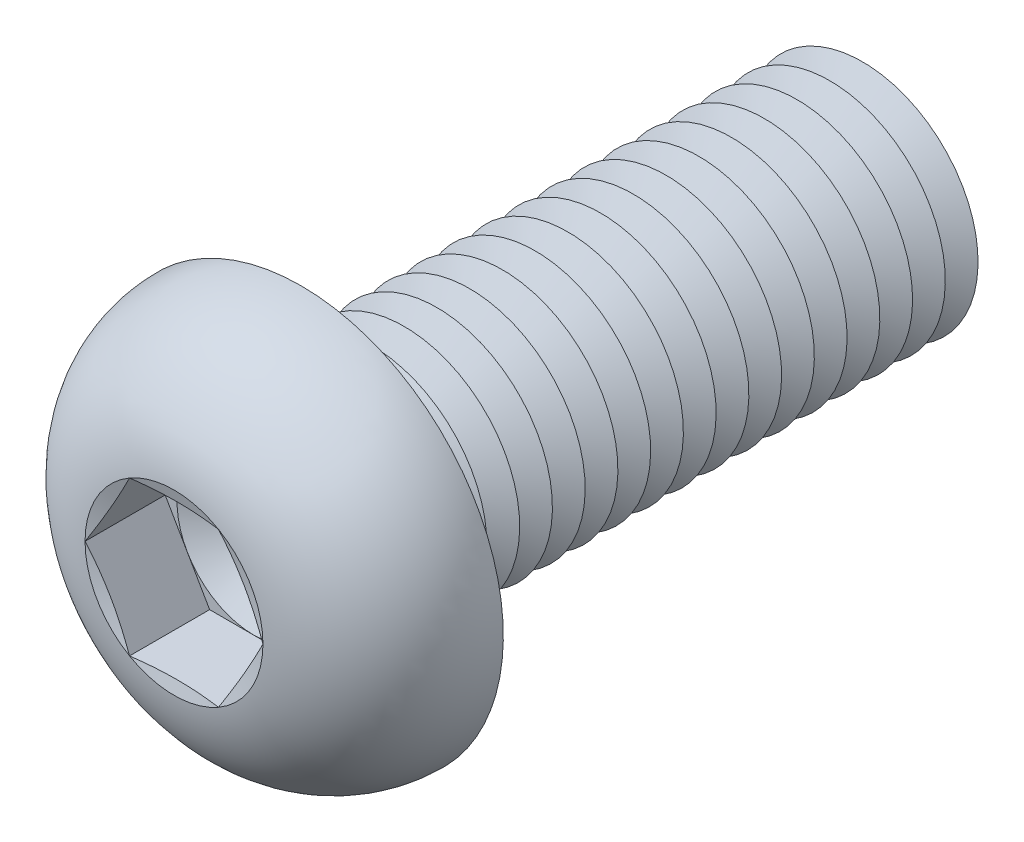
ISO-10303-21;
HEADER;
FILE_DESCRIPTION(('STEP AP214'),'2;1');
FILE_NAME('part.step','',(''),(''),'','','');
FILE_SCHEMA(('AUTOMOTIVE_DESIGN { 1 0 10303 214 1 1 1 1 }'));
ENDSEC;
DATA;
#1=APPLICATION_CONTEXT('core data for automotive mechanical design processes');
#2=APPLICATION_PROTOCOL_DEFINITION('international standard','automotive_design',2000,#1);
#3=PRODUCT_CONTEXT('',#1,'mechanical');
#4=PRODUCT('Part','Part','',(#3));
#5=PRODUCT_RELATED_PRODUCT_CATEGORY('part','',(#4));
#6=PRODUCT_DEFINITION_FORMATION('','',#4);
#7=PRODUCT_DEFINITION_CONTEXT('part definition',#1,'design');
#8=PRODUCT_DEFINITION('design','',#6,#7);
#9=PRODUCT_DEFINITION_SHAPE('','',#8);
#10=(LENGTH_UNIT() NAMED_UNIT(*) SI_UNIT(.MILLI.,.METRE.));
#11=(NAMED_UNIT(*) PLANE_ANGLE_UNIT() SI_UNIT($,.RADIAN.));
#12=(NAMED_UNIT(*) SI_UNIT($,.STERADIAN.) SOLID_ANGLE_UNIT());
#13=UNCERTAINTY_MEASURE_WITH_UNIT(LENGTH_MEASURE(1.E-05),#10,'distance_accuracy_value','');
#14=(GEOMETRIC_REPRESENTATION_CONTEXT(3) GLOBAL_UNCERTAINTY_ASSIGNED_CONTEXT((#13)) GLOBAL_UNIT_ASSIGNED_CONTEXT((#10,
#11,#12)) REPRESENTATION_CONTEXT('',''));
#15=CARTESIAN_POINT('',(0.,0.,0.));
#16=DIRECTION('',(0.,0.,1.));
#17=DIRECTION('',(1.,0.,0.));
#18=AXIS2_PLACEMENT_3D('',#15,#16,#17);
#19=CARTESIAN_POINT('',(0.,0.,2.43999999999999));
#20=DIRECTION('',(0.,0.,1.));
#21=DIRECTION('',(1.,0.,0.));
#22=AXIS2_PLACEMENT_3D('',#19,#20,#21);
#23=PLANE('',#22);
#24=CARTESIAN_POINT('',(0.,0.,2.43999999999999));
#25=DIRECTION('',(0.,0.,1.));
#26=DIRECTION('',(1.,0.,0.));
#27=AXIS2_PLACEMENT_3D('',#24,#25,#26);
#28=CIRCLE('',#27,3.99999813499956);
#29=CARTESIAN_POINT('',(3.4641,1.99999906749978,2.43999999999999));
#30=VERTEX_POINT('',#29);
#31=CARTESIAN_POINT('',(0.,3.99999813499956,2.43999999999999));
#32=VERTEX_POINT('',#31);
#33=EDGE_CURVE('E118',#30,#32,#28,.T.);
#34=ORIENTED_EDGE('',*,*,#33,.F.);
#35=DIRECTION('',(-0.5,0.866025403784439,0.));
#36=VECTOR('',#35,1.);
#37=CARTESIAN_POINT('',(4.6188,0.,2.43999999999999));
#38=LINE('',#37,#36);
#39=CARTESIAN_POINT('',(2.3094,3.99999813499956,2.43999999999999));
#40=VERTEX_POINT('',#39);
#41=EDGE_CURVE('E125',#30,#40,#38,.T.);
#42=ORIENTED_EDGE('',*,*,#41,.T.);
#43=DIRECTION('',(-1.,0.,0.));
#44=VECTOR('',#43,1.);
#45=CARTESIAN_POINT('',(2.3094,3.99999813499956,2.43999999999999));
#46=LINE('',#45,#44);
#47=EDGE_CURVE('E136',#40,#32,#46,.T.);
#48=ORIENTED_EDGE('',*,*,#47,.T.);
#49=EDGE_LOOP('',(#34,#42,#48));
#50=FACE_BOUND('',#49,.T.);
#51=ADVANCED_FACE('F39',(#50),#23,.T.);
#52=CARTESIAN_POINT('',(0.,0.,2.43999999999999));
#53=DIRECTION('',(0.,0.,1.));
#54=DIRECTION('',(1.,0.,0.));
#55=AXIS2_PLACEMENT_3D('',#52,#53,#54);
#56=CIRCLE('',#55,3.99999813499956);
#57=CARTESIAN_POINT('',(-3.4641,1.99999906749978,2.43999999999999));
#58=VERTEX_POINT('',#57);
#59=EDGE_CURVE('E11',#32,#58,#56,.T.);
#60=ORIENTED_EDGE('',*,*,#59,.F.);
#61=CARTESIAN_POINT('',(-2.3094,3.99999813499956,2.43999999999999));
#62=VERTEX_POINT('',#61);
#63=EDGE_CURVE('E131',#32,#62,#46,.T.);
#64=ORIENTED_EDGE('',*,*,#63,.T.);
#65=DIRECTION('',(-0.5,-0.866025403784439,0.));
#66=VECTOR('',#65,1.);
#67=CARTESIAN_POINT('',(-2.3094,3.99999813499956,2.43999999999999));
#68=LINE('',#67,#66);
#69=EDGE_CURVE('E134',#62,#58,#68,.T.);
#70=ORIENTED_EDGE('',*,*,#69,.T.);
#71=EDGE_LOOP('',(#60,#64,#70));
#72=FACE_BOUND('',#71,.T.);
#73=ADVANCED_FACE('F130',(#72),#23,.T.);
#74=CARTESIAN_POINT('',(-3.4641,-1.99999906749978,2.43999999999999));
#75=VERTEX_POINT('',#74);
#76=EDGE_CURVE('E49',#58,#75,#56,.T.);
#77=ORIENTED_EDGE('',*,*,#76,.F.);
#78=CARTESIAN_POINT('',(-4.6188,0.,2.43999999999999));
#79=VERTEX_POINT('',#78);
#80=EDGE_CURVE('E143',#58,#79,#68,.T.);
#81=ORIENTED_EDGE('',*,*,#80,.T.);
#82=DIRECTION('',(0.5,-0.866025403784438,0.));
#83=VECTOR('',#82,1.);
#84=CARTESIAN_POINT('',(-4.6188,0.,2.43999999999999));
#85=LINE('',#84,#83);
#86=EDGE_CURVE('E152',#79,#75,#85,.T.);
#87=ORIENTED_EDGE('',*,*,#86,.T.);
#88=EDGE_LOOP('',(#77,#81,#87));
#89=FACE_BOUND('',#88,.T.);
#90=ADVANCED_FACE('F409',(#89),#23,.T.);
#91=CARTESIAN_POINT('',(0.,-3.99999813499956,2.43999999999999));
#92=VERTEX_POINT('',#91);
#93=EDGE_CURVE('E393',#75,#92,#56,.T.);
#94=ORIENTED_EDGE('',*,*,#93,.F.);
#95=CARTESIAN_POINT('',(-2.3094,-3.99999813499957,2.43999999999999));
#96=VERTEX_POINT('',#95);
#97=EDGE_CURVE('E151',#75,#96,#85,.T.);
#98=ORIENTED_EDGE('',*,*,#97,.T.);
#99=DIRECTION('',(1.,0.,0.));
#100=VECTOR('',#99,1.);
#101=CARTESIAN_POINT('',(-2.3094,-3.99999813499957,2.43999999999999));
#102=LINE('',#101,#100);
#103=EDGE_CURVE('E157',#96,#92,#102,.T.);
#104=ORIENTED_EDGE('',*,*,#103,.T.);
#105=EDGE_LOOP('',(#94,#98,#104));
#106=FACE_BOUND('',#105,.T.);
#107=ADVANCED_FACE('F403',(#106),#23,.T.);
#108=CARTESIAN_POINT('',(3.4641,-1.99999906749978,2.43999999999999));
#109=VERTEX_POINT('',#108);
#110=EDGE_CURVE('E56',#92,#109,#56,.T.);
#111=ORIENTED_EDGE('',*,*,#110,.F.);
#112=CARTESIAN_POINT('',(2.3094,-3.99999813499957,2.43999999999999));
#113=VERTEX_POINT('',#112);
#114=EDGE_CURVE('E156',#92,#113,#102,.T.);
#115=ORIENTED_EDGE('',*,*,#114,.T.);
#116=DIRECTION('',(0.5,0.866025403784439,0.));
#117=VECTOR('',#116,1.);
#118=CARTESIAN_POINT('',(2.3094,-3.99999813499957,2.43999999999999));
#119=LINE('',#118,#117);
#120=EDGE_CURVE('E162',#113,#109,#119,.T.);
#121=ORIENTED_EDGE('',*,*,#120,.T.);
#122=EDGE_LOOP('',(#111,#115,#121));
#123=FACE_BOUND('',#122,.T.);
#124=ADVANCED_FACE('F478',(#123),#23,.T.);
#125=CARTESIAN_POINT('',(0.,0.,6.59999999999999));
#126=DIRECTION('',(0.,0.,1.));
#127=DIRECTION('',(0.,-1.,0.));
#128=AXIS2_PLACEMENT_3D('',#125,#126,#127);
#129=CONICAL_SURFACE('',#128,4.6188,1.30899693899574);
#130=CARTESIAN_POINT('',(4.61891547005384,-0.000200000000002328,6.6000309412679));
#131=CARTESIAN_POINT('',(4.52300232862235,0.165926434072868,6.57431944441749));
#132=CARTESIAN_POINT('',(4.42691527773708,0.332354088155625,6.55097758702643));
#133=CARTESIAN_POINT('',(4.23440181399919,0.665797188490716,6.50996805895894));
#134=CARTESIAN_POINT('',(4.13797527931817,0.83281284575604,6.49230269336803));
#135=CARTESIAN_POINT('',(3.94536752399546,1.16641926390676,6.46367750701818));
#136=CARTESIAN_POINT('',(3.84918760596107,1.33300776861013,6.45268354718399));
#137=CARTESIAN_POINT('',(3.6567051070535,1.66639723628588,6.4379417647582));
#138=CARTESIAN_POINT('',(3.56040255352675,1.83319815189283,6.43419253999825));
#139=CARTESIAN_POINT('',(3.36779744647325,2.16679998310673,6.43419253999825));
#140=CARTESIAN_POINT('',(3.2714948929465,2.33360089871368,6.4379417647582));
#141=CARTESIAN_POINT('',(3.07901239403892,2.66699036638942,6.45268354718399));
#142=CARTESIAN_POINT('',(2.98283247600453,2.8335788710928,6.46367750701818));
#143=CARTESIAN_POINT('',(2.79022472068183,3.16718528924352,6.49230269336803));
#144=CARTESIAN_POINT('',(2.69379818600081,3.33420094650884,6.50996805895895));
#145=CARTESIAN_POINT('',(2.50128472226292,3.66764404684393,6.55097758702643));
#146=CARTESIAN_POINT('',(2.40519767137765,3.83407170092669,6.57431944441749));
#147=CARTESIAN_POINT('',(2.30928452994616,4.00019813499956,6.6000309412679));
#148=B_SPLINE_CURVE_WITH_KNOTS('',3,(#130,#131,#132,#133,#134,#135,#136,#137,#138,#139,#140,
#141,#142,#143,#144,#145,#146,#147),.UNSPECIFIED.,.F.,.F.,(4,2,2,2,2,2,2,2,4),(0.,
0.580655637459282,1.16154676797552,1.73943971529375,2.31722080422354,2.89500189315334,
3.47289484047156,4.05378597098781,4.63444160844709),.UNSPECIFIED.);
#149=CARTESIAN_POINT('',(4.6188,0.,6.59999999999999));
#150=VERTEX_POINT('',#149);
#151=CARTESIAN_POINT('',(2.30939999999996,3.99999813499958,6.6));
#152=VERTEX_POINT('',#151);
#153=EDGE_CURVE('E222',#150,#152,#148,.T.);
#154=ORIENTED_EDGE('',*,*,#153,.F.);
#155=CARTESIAN_POINT('',(0.,0.,6.59999999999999));
#156=DIRECTION('',(0.,0.,-1.));
#157=DIRECTION('',(0.,1.,0.));
#158=AXIS2_PLACEMENT_3D('',#155,#156,#157);
#159=CIRCLE('',#158,4.6188);
#160=EDGE_CURVE('E374',#152,#150,#159,.T.);
#161=ORIENTED_EDGE('',*,*,#160,.F.);
#162=EDGE_LOOP('',(#154,#161));
#163=FACE_BOUND('',#162,.T.);
#164=ADVANCED_FACE('F482',(#163),#129,.F.);
#165=CARTESIAN_POINT('',(2.30928452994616,-4.00019813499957,6.60003094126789));
#166=CARTESIAN_POINT('',(2.40519767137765,-3.8340717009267,6.57431944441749));
#167=CARTESIAN_POINT('',(2.50128472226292,-3.66764404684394,6.55097758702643));
#168=CARTESIAN_POINT('',(2.69379818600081,-3.33420094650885,6.50996805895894));
#169=CARTESIAN_POINT('',(2.79022472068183,-3.16718528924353,6.49230269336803));
#170=CARTESIAN_POINT('',(2.98283247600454,-2.8335788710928,6.46367750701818));
#171=CARTESIAN_POINT('',(3.07901239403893,-2.66699036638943,6.45268354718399));
#172=CARTESIAN_POINT('',(3.2714948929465,-2.33360089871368,6.4379417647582));
#173=CARTESIAN_POINT('',(3.36779744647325,-2.16679998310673,6.43419253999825));
#174=CARTESIAN_POINT('',(3.56040255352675,-1.83319815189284,6.43419253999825));
#175=CARTESIAN_POINT('',(3.6567051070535,-1.66639723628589,6.4379417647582));
#176=CARTESIAN_POINT('',(3.84918760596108,-1.33300776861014,6.45268354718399));
#177=CARTESIAN_POINT('',(3.94536752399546,-1.16641926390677,6.46367750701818));
#178=CARTESIAN_POINT('',(4.13797527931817,-0.832812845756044,6.49230269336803));
#179=CARTESIAN_POINT('',(4.23440181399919,-0.66579718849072,6.50996805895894));
#180=CARTESIAN_POINT('',(4.42691527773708,-0.332354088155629,6.55097758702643));
#181=CARTESIAN_POINT('',(4.52300232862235,-0.165926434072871,6.57431944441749));
#182=CARTESIAN_POINT('',(4.61891547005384,0.000199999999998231,6.6000309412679));
#183=B_SPLINE_CURVE_WITH_KNOTS('',3,(#165,#166,#167,#168,#169,#170,#171,#172,#173,#174,#175,
#176,#177,#178,#179,#180,#181,#182),.UNSPECIFIED.,.F.,.F.,(4,2,2,2,2,2,2,2,4),(0.,
0.580655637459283,1.16154676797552,1.73943971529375,2.31722080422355,2.89500189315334,
3.47289484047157,4.05378597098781,4.63444160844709),.UNSPECIFIED.);
#184=CARTESIAN_POINT('',(2.3094,-3.99999813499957,6.59999999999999));
#185=VERTEX_POINT('',#184);
#186=EDGE_CURVE('E231',#185,#150,#183,.T.);
#187=ORIENTED_EDGE('',*,*,#186,.F.);
#188=EDGE_CURVE('E379',#150,#185,#159,.T.);
#189=ORIENTED_EDGE('',*,*,#188,.F.);
#190=EDGE_LOOP('',(#187,#189));
#191=FACE_BOUND('',#190,.T.);
#192=ADVANCED_FACE('F443',(#191),#129,.F.);
#193=CARTESIAN_POINT('',(-6.96966750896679,-3.99999813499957,7.51561854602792));
#194=CARTESIAN_POINT('',(-6.80094634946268,-3.99999813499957,7.47641178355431));
#195=CARTESIAN_POINT('',(-6.63214895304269,-3.99999813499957,7.43753277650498));
#196=CARTESIAN_POINT('',(-6.29436999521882,-3.99999813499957,7.36057075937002));
#197=CARTESIAN_POINT('',(-6.12538843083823,-3.99999813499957,7.3224877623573));
#198=CARTESIAN_POINT('',(-5.61806276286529,-3.99999813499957,7.20963087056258));
#199=CARTESIAN_POINT('',(-5.27940301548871,-3.99999813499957,7.13626437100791));
#200=CARTESIAN_POINT('',(-4.59775760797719,-3.99999813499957,6.99431141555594));
#201=CARTESIAN_POINT('',(-4.25476115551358,-3.99999813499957,6.92577621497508));
#202=CARTESIAN_POINT('',(-3.56716783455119,-3.99999813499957,6.79696563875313));
#203=CARTESIAN_POINT('',(-3.22257082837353,-3.99999813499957,6.73669098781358));
#204=CARTESIAN_POINT('',(-2.54069952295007,-3.99999813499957,6.63002020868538));
#205=CARTESIAN_POINT('',(-2.20347918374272,-3.99999813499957,6.58329286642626));
#206=CARTESIAN_POINT('',(-1.6962445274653,-3.99999813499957,6.52585827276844));
#207=CARTESIAN_POINT('',(-1.52694760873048,-3.99999813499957,6.50882377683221));
#208=CARTESIAN_POINT('',(-1.187938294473,-3.99999813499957,6.47963274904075));
#209=CARTESIAN_POINT('',(-1.01822592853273,-3.99999813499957,6.4674758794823));
#210=CARTESIAN_POINT('',(-0.679233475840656,-3.99999813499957,6.44863176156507));
#211=CARTESIAN_POINT('',(-0.509954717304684,-3.99999813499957,6.44192096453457));
#212=CARTESIAN_POINT('',(-0.171265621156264,-3.99999813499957,6.43422163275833));
#213=CARTESIAN_POINT('',(-0.00185528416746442,-3.99999813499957,6.43323307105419));
#214=CARTESIAN_POINT('',(0.336912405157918,-3.99999813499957,6.43703123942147));
#215=CARTESIAN_POINT('',(0.506269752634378,-3.99999813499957,6.44181839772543));
#216=CARTESIAN_POINT('',(0.844732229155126,-3.99999813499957,6.45691823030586));
#217=CARTESIAN_POINT('',(1.01383735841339,-3.99999813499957,6.46723089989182));
#218=CARTESIAN_POINT('',(1.42449950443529,-3.99999813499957,6.49843349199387));
#219=CARTESIAN_POINT('',(1.66585565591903,-3.99999813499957,6.52196685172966));
#220=CARTESIAN_POINT('',(2.14755410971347,-3.99999813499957,6.57749710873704));
#221=CARTESIAN_POINT('',(2.3878964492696,-3.99999813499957,6.60949369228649));
#222=CARTESIAN_POINT('',(2.86835569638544,-3.99999813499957,6.68017769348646));
#223=CARTESIAN_POINT('',(3.10846949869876,-3.99999813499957,6.71888590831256));
#224=CARTESIAN_POINT('',(3.5878341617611,-3.99999813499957,6.80132981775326));
#225=CARTESIAN_POINT('',(3.82708497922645,-3.99999813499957,6.84506576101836));
#226=CARTESIAN_POINT('',(4.30977392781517,-3.99999813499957,6.93726543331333));
#227=CARTESIAN_POINT('',(4.55319689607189,-3.99999813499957,6.98580793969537));
#228=CARTESIAN_POINT('',(5.03943022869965,-3.99999813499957,7.08586668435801));
#229=CARTESIAN_POINT('',(5.28224058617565,-3.99999813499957,7.13738295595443));
#230=CARTESIAN_POINT('',(5.76604885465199,-3.99999813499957,7.24238429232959));
#231=CARTESIAN_POINT('',(6.00704943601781,-3.99999813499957,7.29585711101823));
#232=CARTESIAN_POINT('',(6.48863948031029,-3.99999813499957,7.4045482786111));
#233=CARTESIAN_POINT('',(6.72922897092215,-3.99999813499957,7.45976650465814));
#234=CARTESIAN_POINT('',(6.9696675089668,-3.99999813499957,7.51561854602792));
#235=B_SPLINE_CURVE_WITH_KNOTS('',3,(#193,#194,#195,#196,#197,#198,#199,#200,#201,#202,#203,
#204,#205,#206,#207,#208,#209,#210,#211,#212,#213,#214,#215,#216,#217,#218,#219,#220,#221,#222,
#223,#224,#225,#226,#227,#228,#229,#230,#231,#232,#233,#234),.UNSPECIFIED.,.F.,.F.,(4,2,2,2,2,2,
2,2,2,2,2,2,2,2,2,2,2,2,2,2,4),(0.,0.519649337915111,1.03930720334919,2.07882421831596,
3.12808572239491,4.17743921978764,5.19841727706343,5.7088142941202,6.21917596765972,
6.7273189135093,7.23545946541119,7.74363769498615,8.25181549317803,8.9791183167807,
9.70639418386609,10.4359652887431,11.1655724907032,11.910195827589,12.6548275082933,
13.395405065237,14.1359306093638),.UNSPECIFIED.);
#236=CARTESIAN_POINT('',(-2.3094,-3.99999813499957,6.59999999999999));
#237=VERTEX_POINT('',#236);
#238=EDGE_CURVE('E423',#237,#185,#235,.T.);
#239=ORIENTED_EDGE('',*,*,#238,.F.);
#240=EDGE_CURVE('E435',#185,#237,#159,.T.);
#241=ORIENTED_EDGE('',*,*,#240,.F.);
#242=EDGE_LOOP('',(#239,#241));
#243=FACE_BOUND('',#242,.T.);
#244=ADVANCED_FACE('F449',(#243),#129,.F.);
#245=CARTESIAN_POINT('',(-4.61891547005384,0.000199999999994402,6.6000309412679));
#246=CARTESIAN_POINT('',(-4.52300232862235,-0.165926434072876,6.57431944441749));
#247=CARTESIAN_POINT('',(-4.42691527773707,-0.332354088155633,6.55097758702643));
#248=CARTESIAN_POINT('',(-4.23440181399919,-0.665797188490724,6.50996805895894));
#249=CARTESIAN_POINT('',(-4.13797527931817,-0.832812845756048,6.49230269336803));
#250=CARTESIAN_POINT('',(-3.94536752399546,-1.16641926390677,6.46367750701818));
#251=CARTESIAN_POINT('',(-3.84918760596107,-1.33300776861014,6.45268354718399));
#252=CARTESIAN_POINT('',(-3.6567051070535,-1.66639723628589,6.4379417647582));
#253=CARTESIAN_POINT('',(-3.56040255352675,-1.83319815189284,6.43419253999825));
#254=CARTESIAN_POINT('',(-3.36779744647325,-2.16679998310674,6.43419253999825));
#255=CARTESIAN_POINT('',(-3.2714948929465,-2.33360089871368,6.4379417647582));
#256=CARTESIAN_POINT('',(-3.07901239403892,-2.66699036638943,6.45268354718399));
#257=CARTESIAN_POINT('',(-2.98283247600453,-2.83357887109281,6.46367750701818));
#258=CARTESIAN_POINT('',(-2.79022472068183,-3.16718528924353,6.49230269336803));
#259=CARTESIAN_POINT('',(-2.69379818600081,-3.33420094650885,6.50996805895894));
#260=CARTESIAN_POINT('',(-2.50128472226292,-3.66764404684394,6.55097758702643));
#261=CARTESIAN_POINT('',(-2.40519767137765,-3.8340717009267,6.57431944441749));
#262=CARTESIAN_POINT('',(-2.30928452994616,-4.00019813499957,6.60003094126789));
#263=B_SPLINE_CURVE_WITH_KNOTS('',3,(#245,#246,#247,#248,#249,#250,#251,#252,#253,#254,#255,
#256,#257,#258,#259,#260,#261,#262),.UNSPECIFIED.,.F.,.F.,(4,2,2,2,2,2,2,2,4),(0.,
0.580655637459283,1.16154676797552,1.73943971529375,2.31722080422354,2.89500189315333,
3.47289484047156,4.05378597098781,4.63444160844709),.UNSPECIFIED.);
#264=CARTESIAN_POINT('',(-4.6188,0.,6.59999999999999));
#265=VERTEX_POINT('',#264);
#266=EDGE_CURVE('E414',#265,#237,#263,.T.);
#267=ORIENTED_EDGE('',*,*,#266,.F.);
#268=EDGE_CURVE('E420',#237,#265,#159,.T.);
#269=ORIENTED_EDGE('',*,*,#268,.F.);
#270=EDGE_LOOP('',(#267,#269));
#271=FACE_BOUND('',#270,.T.);
#272=ADVANCED_FACE('F418',(#271),#129,.F.);
#273=CARTESIAN_POINT('',(-2.30928452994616,4.00019813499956,6.6000309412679));
#274=CARTESIAN_POINT('',(-2.40519767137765,3.83407170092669,6.57431944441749));
#275=CARTESIAN_POINT('',(-2.50128472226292,3.66764404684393,6.55097758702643));
#276=CARTESIAN_POINT('',(-2.69379818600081,3.33420094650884,6.50996805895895));
#277=CARTESIAN_POINT('',(-2.79022472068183,3.16718528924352,6.49230269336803));
#278=CARTESIAN_POINT('',(-2.98283247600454,2.8335788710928,6.46367750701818));
#279=CARTESIAN_POINT('',(-3.07901239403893,2.66699036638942,6.45268354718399));
#280=CARTESIAN_POINT('',(-3.2714948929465,2.33360089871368,6.4379417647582));
#281=CARTESIAN_POINT('',(-3.36779744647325,2.16679998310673,6.43419253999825));
#282=CARTESIAN_POINT('',(-3.56040255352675,1.83319815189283,6.43419253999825));
#283=CARTESIAN_POINT('',(-3.6567051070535,1.66639723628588,6.4379417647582));
#284=CARTESIAN_POINT('',(-3.84918760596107,1.33300776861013,6.45268354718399));
#285=CARTESIAN_POINT('',(-3.94536752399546,1.16641926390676,6.46367750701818));
#286=CARTESIAN_POINT('',(-4.13797527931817,0.832812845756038,6.49230269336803));
#287=CARTESIAN_POINT('',(-4.23440181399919,0.665797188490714,6.50996805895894));
#288=CARTESIAN_POINT('',(-4.42691527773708,0.332354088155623,6.55097758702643));
#289=CARTESIAN_POINT('',(-4.52300232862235,0.165926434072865,6.57431944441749));
#290=CARTESIAN_POINT('',(-4.61891547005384,-0.000200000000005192,6.6000309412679));
#291=B_SPLINE_CURVE_WITH_KNOTS('',3,(#273,#274,#275,#276,#277,#278,#279,#280,#281,#282,#283,
#284,#285,#286,#287,#288,#289,#290),.UNSPECIFIED.,.F.,.F.,(4,2,2,2,2,2,2,2,4),(0.,
0.580655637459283,1.16154676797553,1.73943971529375,2.31722080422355,2.89500189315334,
3.47289484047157,4.05378597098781,4.63444160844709),.UNSPECIFIED.);
#292=CARTESIAN_POINT('',(-2.3094,3.99999813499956,6.59999999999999));
#293=VERTEX_POINT('',#292);
#294=EDGE_CURVE('E195',#293,#265,#291,.T.);
#295=ORIENTED_EDGE('',*,*,#294,.F.);
#296=EDGE_CURVE('E426',#265,#293,#159,.T.);
#297=ORIENTED_EDGE('',*,*,#296,.F.);
#298=EDGE_LOOP('',(#295,#297));
#299=FACE_BOUND('',#298,.T.);
#300=ADVANCED_FACE('F427',(#299),#129,.F.);
#301=CARTESIAN_POINT('',(0.,0.,-24.05));
#302=DIRECTION('',(0.,0.,1.));
#303=DIRECTION('',(0.,-1.,0.));
#304=AXIS2_PLACEMENT_3D('',#301,#302,#303);
#305=CONICAL_SURFACE('',#304,5.99999999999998,1.0471975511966);
#306=CARTESIAN_POINT('',(0.,0.,-24.9));
#307=DIRECTION('',(0.,0.,1.));
#308=DIRECTION('',(0.,-1.,0.));
#309=AXIS2_PLACEMENT_3D('',#306,#307,#308);
#310=CIRCLE('',#309,4.52775681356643);
#311=CARTESIAN_POINT('',(0.,-4.52775681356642,-24.9));
#312=VERTEX_POINT('',#311);
#313=EDGE_CURVE('E345',#312,#312,#310,.T.);
#314=ORIENTED_EDGE('',*,*,#313,.T.);
#315=EDGE_LOOP('',(#314));
#316=FACE_BOUND('',#315,.T.);
#317=CARTESIAN_POINT('',(0.,0.,-24.05));
#318=DIRECTION('',(0.,0.,1.));
#319=DIRECTION('',(0.,-1.,0.));
#320=AXIS2_PLACEMENT_3D('',#317,#318,#319);
#321=CIRCLE('',#320,5.99999999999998);
#322=CARTESIAN_POINT('',(0.,-5.99999999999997,-24.05));
#323=VERTEX_POINT('',#322);
#324=EDGE_CURVE('E341',#323,#323,#321,.T.);
#325=ORIENTED_EDGE('',*,*,#324,.F.);
#326=EDGE_LOOP('',(#325));
#327=FACE_BOUND('',#326,.T.);
#328=ADVANCED_FACE('F509',(#316,#327),#305,.T.);
#329=CARTESIAN_POINT('',(0.,0.,-24.9));
#330=DIRECTION('',(0.,0.,-1.));
#331=DIRECTION('',(0.,1.,0.));
#332=AXIS2_PLACEMENT_3D('',#329,#330,#331);
#333=CONICAL_SURFACE('',#332,4.52775681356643,1.0471975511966);
#334=CARTESIAN_POINT('',(0.,0.,-25.75));
#335=DIRECTION('',(0.,0.,1.));
#336=DIRECTION('',(0.,-1.,0.));
#337=AXIS2_PLACEMENT_3D('',#334,#335,#336);
#338=CIRCLE('',#337,5.99999999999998);
#339=CARTESIAN_POINT('',(0.,-5.99999999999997,-25.75));
#340=VERTEX_POINT('',#339);
#341=EDGE_CURVE('E349',#340,#340,#338,.T.);
#342=ORIENTED_EDGE('',*,*,#341,.T.);
#343=EDGE_LOOP('',(#342));
#344=FACE_BOUND('',#343,.T.);
#345=ORIENTED_EDGE('',*,*,#313,.F.);
#346=EDGE_LOOP('',(#345));
#347=FACE_BOUND('',#346,.T.);
#348=ADVANCED_FACE('F514',(#344,#347),#333,.T.);
#349=CARTESIAN_POINT('',(0.,6.,-30.));
#350=DIRECTION('',(0.,0.,-1.));
#351=DIRECTION('',(0.,1.,0.));
#352=AXIS2_PLACEMENT_3D('',#349,#350,#351);
#353=PLANE('',#352);
#354=CARTESIAN_POINT('',(0.,0.,-30.));
#355=DIRECTION('',(0.,0.,1.));
#356=DIRECTION('',(0.,-1.,0.));
#357=AXIS2_PLACEMENT_3D('',#354,#355,#356);
#358=CIRCLE('',#357,4.52775681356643);
#359=CARTESIAN_POINT('',(0.,-4.52775681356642,-30.));
#360=VERTEX_POINT('',#359);
#361=EDGE_CURVE('E369',#360,#360,#358,.T.);
#362=ORIENTED_EDGE('',*,*,#361,.F.);
#363=EDGE_LOOP('',(#362));
#364=FACE_BOUND('',#363,.T.);
#365=ADVANCED_FACE('F689',(#364),#353,.T.);
#366=CARTESIAN_POINT('',(0.,0.,-29.15));
#367=DIRECTION('',(0.,0.,1.));
#368=DIRECTION('',(0.,-1.,0.));
#369=AXIS2_PLACEMENT_3D('',#366,#367,#368);
#370=CONICAL_SURFACE('',#369,5.99999999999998,1.0471975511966);
#371=ORIENTED_EDGE('',*,*,#361,.T.);
#372=EDGE_LOOP('',(#371));
#373=FACE_BOUND('',#372,.T.);
#374=CARTESIAN_POINT('',(0.,0.,-29.15));
#375=DIRECTION('',(0.,0.,1.));
#376=DIRECTION('',(0.,-1.,0.));
#377=AXIS2_PLACEMENT_3D('',#374,#375,#376);
#378=CIRCLE('',#377,5.99999999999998);
#379=CARTESIAN_POINT('',(0.,-5.99999999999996,-29.15));
#380=VERTEX_POINT('',#379);
#381=EDGE_CURVE('E365',#380,#380,#378,.T.);
#382=ORIENTED_EDGE('',*,*,#381,.F.);
#383=EDGE_LOOP('',(#382));
#384=FACE_BOUND('',#383,.T.);
#385=ADVANCED_FACE('F682',(#373,#384),#370,.T.);
#386=CARTESIAN_POINT('',(0.,0.,-28.3));
#387=DIRECTION('',(0.,0.,-1.));
#388=DIRECTION('',(0.,1.,0.));
#389=AXIS2_PLACEMENT_3D('',#386,#387,#388);
#390=CONICAL_SURFACE('',#389,4.52775681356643,1.0471975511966);
#391=ORIENTED_EDGE('',*,*,#381,.T.);
#392=EDGE_LOOP('',(#391));
#393=FACE_BOUND('',#392,.T.);
#394=CARTESIAN_POINT('',(0.,0.,-28.3));
#395=DIRECTION('',(0.,0.,1.));
#396=DIRECTION('',(0.,-1.,0.));
#397=AXIS2_PLACEMENT_3D('',#394,#395,#396);
#398=CIRCLE('',#397,4.52775681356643);
#399=CARTESIAN_POINT('',(0.,-4.52775681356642,-28.3));
#400=VERTEX_POINT('',#399);
#401=EDGE_CURVE('E361',#400,#400,#398,.T.);
#402=ORIENTED_EDGE('',*,*,#401,.F.);
#403=EDGE_LOOP('',(#402));
#404=FACE_BOUND('',#403,.T.);
#405=ADVANCED_FACE('F688',(#393,#404),#390,.T.);
#406=CARTESIAN_POINT('',(0.,0.,-27.45));
#407=DIRECTION('',(0.,0.,1.));
#408=DIRECTION('',(0.,-1.,0.));
#409=AXIS2_PLACEMENT_3D('',#406,#407,#408);
#410=CONICAL_SURFACE('',#409,5.99999999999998,1.0471975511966);
#411=ORIENTED_EDGE('',*,*,#401,.T.);
#412=EDGE_LOOP('',(#411));
#413=FACE_BOUND('',#412,.T.);
#414=CARTESIAN_POINT('',(0.,0.,-27.45));
#415=DIRECTION('',(0.,0.,1.));
#416=DIRECTION('',(0.,-1.,0.));
#417=AXIS2_PLACEMENT_3D('',#414,#415,#416);
#418=CIRCLE('',#417,5.99999999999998);
#419=CARTESIAN_POINT('',(0.,-5.99999999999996,-27.45));
#420=VERTEX_POINT('',#419);
#421=EDGE_CURVE('E357',#420,#420,#418,.T.);
#422=ORIENTED_EDGE('',*,*,#421,.F.);
#423=EDGE_LOOP('',(#422));
#424=FACE_BOUND('',#423,.T.);
#425=ADVANCED_FACE('F720',(#413,#424),#410,.T.);
#426=CARTESIAN_POINT('',(0.,0.,-26.6));
#427=DIRECTION('',(0.,0.,-1.));
#428=DIRECTION('',(0.,1.,0.));
#429=AXIS2_PLACEMENT_3D('',#426,#427,#428);
#430=CONICAL_SURFACE('',#429,4.52775681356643,1.0471975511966);
#431=ORIENTED_EDGE('',*,*,#421,.T.);
#432=EDGE_LOOP('',(#431));
#433=FACE_BOUND('',#432,.T.);
#434=CARTESIAN_POINT('',(0.,0.,-26.6));
#435=DIRECTION('',(0.,0.,1.));
#436=DIRECTION('',(0.,-1.,0.));
#437=AXIS2_PLACEMENT_3D('',#434,#435,#436);
#438=CIRCLE('',#437,4.52775681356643);
#439=CARTESIAN_POINT('',(0.,-4.52775681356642,-26.6));
#440=VERTEX_POINT('',#439);
#441=EDGE_CURVE('E353',#440,#440,#438,.T.);
#442=ORIENTED_EDGE('',*,*,#441,.F.);
#443=EDGE_LOOP('',(#442));
#444=FACE_BOUND('',#443,.T.);
#445=ADVANCED_FACE('F730',(#433,#444),#430,.T.);
#446=CARTESIAN_POINT('',(0.,0.,-25.75));
#447=DIRECTION('',(0.,0.,1.));
#448=DIRECTION('',(0.,-1.,0.));
#449=AXIS2_PLACEMENT_3D('',#446,#447,#448);
#450=CONICAL_SURFACE('',#449,5.99999999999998,1.0471975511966);
#451=ORIENTED_EDGE('',*,*,#441,.T.);
#452=EDGE_LOOP('',(#451));
#453=FACE_BOUND('',#452,.T.);
#454=ORIENTED_EDGE('',*,*,#341,.F.);
#455=EDGE_LOOP('',(#454));
#456=FACE_BOUND('',#455,.T.);
#457=ADVANCED_FACE('F740',(#453,#456),#450,.T.);
#458=CARTESIAN_POINT('',(0.,0.,-22.35));
#459=DIRECTION('',(0.,0.,1.));
#460=DIRECTION('',(0.,-1.,0.));
#461=AXIS2_PLACEMENT_3D('',#458,#459,#460);
#462=CONICAL_SURFACE('',#461,5.99999999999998,1.0471975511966);
#463=CARTESIAN_POINT('',(0.,0.,-23.2));
#464=DIRECTION('',(0.,0.,1.));
#465=DIRECTION('',(0.,-1.,0.));
#466=AXIS2_PLACEMENT_3D('',#463,#464,#465);
#467=CIRCLE('',#466,4.52775681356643);
#468=CARTESIAN_POINT('',(0.,-4.52775681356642,-23.2));
#469=VERTEX_POINT('',#468);
#470=EDGE_CURVE('E337',#469,#469,#467,.T.);
#471=ORIENTED_EDGE('',*,*,#470,.T.);
#472=EDGE_LOOP('',(#471));
#473=FACE_BOUND('',#472,.T.);
#474=CARTESIAN_POINT('',(0.,0.,-22.35));
#475=DIRECTION('',(0.,0.,1.));
#476=DIRECTION('',(0.,-1.,0.));
#477=AXIS2_PLACEMENT_3D('',#474,#475,#476);
#478=CIRCLE('',#477,5.99999999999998);
#479=CARTESIAN_POINT('',(0.,-5.99999999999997,-22.35));
#480=VERTEX_POINT('',#479);
#481=EDGE_CURVE('E333',#480,#480,#478,.T.);
#482=ORIENTED_EDGE('',*,*,#481,.F.);
#483=EDGE_LOOP('',(#482));
#484=FACE_BOUND('',#483,.T.);
#485=ADVANCED_FACE('F750',(#473,#484),#462,.T.);
#486=CARTESIAN_POINT('',(0.,0.,-23.2));
#487=DIRECTION('',(0.,0.,-1.));
#488=DIRECTION('',(0.,1.,0.));
#489=AXIS2_PLACEMENT_3D('',#486,#487,#488);
#490=CONICAL_SURFACE('',#489,4.52775681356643,1.0471975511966);
#491=ORIENTED_EDGE('',*,*,#324,.T.);
#492=EDGE_LOOP('',(#491));
#493=FACE_BOUND('',#492,.T.);
#494=ORIENTED_EDGE('',*,*,#470,.F.);
#495=EDGE_LOOP('',(#494));
#496=FACE_BOUND('',#495,.T.);
#497=ADVANCED_FACE('F760',(#493,#496),#490,.T.);
#498=CARTESIAN_POINT('',(0.,0.,-20.65));
#499=DIRECTION('',(0.,0.,1.));
#500=DIRECTION('',(0.,-1.,0.));
#501=AXIS2_PLACEMENT_3D('',#498,#499,#500);
#502=CONICAL_SURFACE('',#501,5.99999999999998,1.0471975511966);
#503=CARTESIAN_POINT('',(0.,0.,-21.5));
#504=DIRECTION('',(0.,0.,1.));
#505=DIRECTION('',(0.,-1.,0.));
#506=AXIS2_PLACEMENT_3D('',#503,#504,#505);
#507=CIRCLE('',#506,4.52775681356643);
#508=CARTESIAN_POINT('',(0.,-4.52775681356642,-21.5));
#509=VERTEX_POINT('',#508);
#510=EDGE_CURVE('E329',#509,#509,#507,.T.);
#511=ORIENTED_EDGE('',*,*,#510,.T.);
#512=EDGE_LOOP('',(#511));
#513=FACE_BOUND('',#512,.T.);
#514=CARTESIAN_POINT('',(0.,0.,-20.65));
#515=DIRECTION('',(0.,0.,1.));
#516=DIRECTION('',(0.,-1.,0.));
#517=AXIS2_PLACEMENT_3D('',#514,#515,#516);
#518=CIRCLE('',#517,5.99999999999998);
#519=CARTESIAN_POINT('',(0.,-5.99999999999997,-20.65));
#520=VERTEX_POINT('',#519);
#521=EDGE_CURVE('E325',#520,#520,#518,.T.);
#522=ORIENTED_EDGE('',*,*,#521,.F.);
#523=EDGE_LOOP('',(#522));
#524=FACE_BOUND('',#523,.T.);
#525=ADVANCED_FACE('F770',(#513,#524),#502,.T.);
#526=CARTESIAN_POINT('',(0.,0.,-21.5));
#527=DIRECTION('',(0.,0.,-1.));
#528=DIRECTION('',(0.,1.,0.));
#529=AXIS2_PLACEMENT_3D('',#526,#527,#528);
#530=CONICAL_SURFACE('',#529,4.52775681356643,1.0471975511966);
#531=ORIENTED_EDGE('',*,*,#481,.T.);
#532=EDGE_LOOP('',(#531));
#533=FACE_BOUND('',#532,.T.);
#534=ORIENTED_EDGE('',*,*,#510,.F.);
#535=EDGE_LOOP('',(#534));
#536=FACE_BOUND('',#535,.T.);
#537=ADVANCED_FACE('F780',(#533,#536),#530,.T.);
#538=CARTESIAN_POINT('',(0.,0.,-18.95));
#539=DIRECTION('',(0.,0.,1.));
#540=DIRECTION('',(0.,-1.,0.));
#541=AXIS2_PLACEMENT_3D('',#538,#539,#540);
#542=CONICAL_SURFACE('',#541,5.99999999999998,1.0471975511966);
#543=CARTESIAN_POINT('',(0.,0.,-19.8));
#544=DIRECTION('',(0.,0.,1.));
#545=DIRECTION('',(0.,-1.,0.));
#546=AXIS2_PLACEMENT_3D('',#543,#544,#545);
#547=CIRCLE('',#546,4.52775681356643);
#548=CARTESIAN_POINT('',(0.,-4.52775681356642,-19.8));
#549=VERTEX_POINT('',#548);
#550=EDGE_CURVE('E321',#549,#549,#547,.T.);
#551=ORIENTED_EDGE('',*,*,#550,.T.);
#552=EDGE_LOOP('',(#551));
#553=FACE_BOUND('',#552,.T.);
#554=CARTESIAN_POINT('',(0.,0.,-18.95));
#555=DIRECTION('',(0.,0.,1.));
#556=DIRECTION('',(0.,-1.,0.));
#557=AXIS2_PLACEMENT_3D('',#554,#555,#556);
#558=CIRCLE('',#557,5.99999999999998);
#559=CARTESIAN_POINT('',(0.,-5.99999999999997,-18.95));
#560=VERTEX_POINT('',#559);
#561=EDGE_CURVE('E317',#560,#560,#558,.T.);
#562=ORIENTED_EDGE('',*,*,#561,.F.);
#563=EDGE_LOOP('',(#562));
#564=FACE_BOUND('',#563,.T.);
#565=ADVANCED_FACE('F790',(#553,#564),#542,.T.);
#566=CARTESIAN_POINT('',(0.,0.,-19.8));
#567=DIRECTION('',(0.,0.,-1.));
#568=DIRECTION('',(0.,1.,0.));
#569=AXIS2_PLACEMENT_3D('',#566,#567,#568);
#570=CONICAL_SURFACE('',#569,4.52775681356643,1.0471975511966);
#571=ORIENTED_EDGE('',*,*,#521,.T.);
#572=EDGE_LOOP('',(#571));
#573=FACE_BOUND('',#572,.T.);
#574=ORIENTED_EDGE('',*,*,#550,.F.);
#575=EDGE_LOOP('',(#574));
#576=FACE_BOUND('',#575,.T.);
#577=ADVANCED_FACE('F800',(#573,#576),#570,.T.);
#578=CARTESIAN_POINT('',(0.,0.,-17.25));
#579=DIRECTION('',(0.,0.,1.));
#580=DIRECTION('',(0.,-1.,0.));
#581=AXIS2_PLACEMENT_3D('',#578,#579,#580);
#582=CONICAL_SURFACE('',#581,5.99999999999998,1.0471975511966);
#583=CARTESIAN_POINT('',(0.,0.,-18.1));
#584=DIRECTION('',(0.,0.,1.));
#585=DIRECTION('',(0.,-1.,0.));
#586=AXIS2_PLACEMENT_3D('',#583,#584,#585);
#587=CIRCLE('',#586,4.52775681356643);
#588=CARTESIAN_POINT('',(0.,-4.52775681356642,-18.1));
#589=VERTEX_POINT('',#588);
#590=EDGE_CURVE('E313',#589,#589,#587,.T.);
#591=ORIENTED_EDGE('',*,*,#590,.T.);
#592=EDGE_LOOP('',(#591));
#593=FACE_BOUND('',#592,.T.);
#594=CARTESIAN_POINT('',(0.,0.,-17.25));
#595=DIRECTION('',(0.,0.,1.));
#596=DIRECTION('',(0.,-1.,0.));
#597=AXIS2_PLACEMENT_3D('',#594,#595,#596);
#598=CIRCLE('',#597,5.99999999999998);
#599=CARTESIAN_POINT('',(0.,-5.99999999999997,-17.25));
#600=VERTEX_POINT('',#599);
#601=EDGE_CURVE('E309',#600,#600,#598,.T.);
#602=ORIENTED_EDGE('',*,*,#601,.F.);
#603=EDGE_LOOP('',(#602));
#604=FACE_BOUND('',#603,.T.);
#605=ADVANCED_FACE('F810',(#593,#604),#582,.T.);
#606=CARTESIAN_POINT('',(0.,0.,-18.1));
#607=DIRECTION('',(0.,0.,-1.));
#608=DIRECTION('',(0.,1.,0.));
#609=AXIS2_PLACEMENT_3D('',#606,#607,#608);
#610=CONICAL_SURFACE('',#609,4.52775681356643,1.0471975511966);
#611=ORIENTED_EDGE('',*,*,#561,.T.);
#612=EDGE_LOOP('',(#611));
#613=FACE_BOUND('',#612,.T.);
#614=ORIENTED_EDGE('',*,*,#590,.F.);
#615=EDGE_LOOP('',(#614));
#616=FACE_BOUND('',#615,.T.);
#617=ADVANCED_FACE('F820',(#613,#616),#610,.T.);
#618=CARTESIAN_POINT('',(0.,0.,-15.55));
#619=DIRECTION('',(0.,0.,1.));
#620=DIRECTION('',(0.,-1.,0.));
#621=AXIS2_PLACEMENT_3D('',#618,#619,#620);
#622=CONICAL_SURFACE('',#621,5.99999999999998,1.0471975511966);
#623=CARTESIAN_POINT('',(0.,0.,-16.4));
#624=DIRECTION('',(0.,0.,1.));
#625=DIRECTION('',(0.,-1.,0.));
#626=AXIS2_PLACEMENT_3D('',#623,#624,#625);
#627=CIRCLE('',#626,4.52775681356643);
#628=CARTESIAN_POINT('',(0.,-4.52775681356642,-16.4));
#629=VERTEX_POINT('',#628);
#630=EDGE_CURVE('E305',#629,#629,#627,.T.);
#631=ORIENTED_EDGE('',*,*,#630,.T.);
#632=EDGE_LOOP('',(#631));
#633=FACE_BOUND('',#632,.T.);
#634=CARTESIAN_POINT('',(0.,0.,-15.55));
#635=DIRECTION('',(0.,0.,1.));
#636=DIRECTION('',(0.,-1.,0.));
#637=AXIS2_PLACEMENT_3D('',#634,#635,#636);
#638=CIRCLE('',#637,5.99999999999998);
#639=CARTESIAN_POINT('',(0.,-5.99999999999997,-15.55));
#640=VERTEX_POINT('',#639);
#641=EDGE_CURVE('E301',#640,#640,#638,.T.);
#642=ORIENTED_EDGE('',*,*,#641,.F.);
#643=EDGE_LOOP('',(#642));
#644=FACE_BOUND('',#643,.T.);
#645=ADVANCED_FACE('F830',(#633,#644),#622,.T.);
#646=CARTESIAN_POINT('',(0.,0.,-16.4));
#647=DIRECTION('',(0.,0.,-1.));
#648=DIRECTION('',(0.,1.,0.));
#649=AXIS2_PLACEMENT_3D('',#646,#647,#648);
#650=CONICAL_SURFACE('',#649,4.52775681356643,1.0471975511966);
#651=ORIENTED_EDGE('',*,*,#601,.T.);
#652=EDGE_LOOP('',(#651));
#653=FACE_BOUND('',#652,.T.);
#654=ORIENTED_EDGE('',*,*,#630,.F.);
#655=EDGE_LOOP('',(#654));
#656=FACE_BOUND('',#655,.T.);
#657=ADVANCED_FACE('F840',(#653,#656),#650,.T.);
#658=CARTESIAN_POINT('',(0.,0.,-13.85));
#659=DIRECTION('',(0.,0.,1.));
#660=DIRECTION('',(0.,-1.,0.));
#661=AXIS2_PLACEMENT_3D('',#658,#659,#660);
#662=CONICAL_SURFACE('',#661,5.99999999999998,1.0471975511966);
#663=CARTESIAN_POINT('',(0.,0.,-14.7));
#664=DIRECTION('',(0.,0.,1.));
#665=DIRECTION('',(0.,-1.,0.));
#666=AXIS2_PLACEMENT_3D('',#663,#664,#665);
#667=CIRCLE('',#666,4.52775681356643);
#668=CARTESIAN_POINT('',(0.,-4.52775681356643,-14.7));
#669=VERTEX_POINT('',#668);
#670=EDGE_CURVE('E297',#669,#669,#667,.T.);
#671=ORIENTED_EDGE('',*,*,#670,.T.);
#672=EDGE_LOOP('',(#671));
#673=FACE_BOUND('',#672,.T.);
#674=CARTESIAN_POINT('',(0.,0.,-13.85));
#675=DIRECTION('',(0.,0.,1.));
#676=DIRECTION('',(0.,-1.,0.));
#677=AXIS2_PLACEMENT_3D('',#674,#675,#676);
#678=CIRCLE('',#677,5.99999999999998);
#679=CARTESIAN_POINT('',(0.,-5.99999999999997,-13.85));
#680=VERTEX_POINT('',#679);
#681=EDGE_CURVE('E293',#680,#680,#678,.T.);
#682=ORIENTED_EDGE('',*,*,#681,.F.);
#683=EDGE_LOOP('',(#682));
#684=FACE_BOUND('',#683,.T.);
#685=ADVANCED_FACE('F850',(#673,#684),#662,.T.);
#686=CARTESIAN_POINT('',(0.,0.,-14.7));
#687=DIRECTION('',(0.,0.,-1.));
#688=DIRECTION('',(0.,1.,0.));
#689=AXIS2_PLACEMENT_3D('',#686,#687,#688);
#690=CONICAL_SURFACE('',#689,4.52775681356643,1.0471975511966);
#691=ORIENTED_EDGE('',*,*,#641,.T.);
#692=EDGE_LOOP('',(#691));
#693=FACE_BOUND('',#692,.T.);
#694=ORIENTED_EDGE('',*,*,#670,.F.);
#695=EDGE_LOOP('',(#694));
#696=FACE_BOUND('',#695,.T.);
#697=ADVANCED_FACE('F860',(#693,#696),#690,.T.);
#698=CARTESIAN_POINT('',(0.,0.,-12.15));
#699=DIRECTION('',(0.,0.,1.));
#700=DIRECTION('',(0.,-1.,0.));
#701=AXIS2_PLACEMENT_3D('',#698,#699,#700);
#702=CONICAL_SURFACE('',#701,5.99999999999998,1.0471975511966);
#703=CARTESIAN_POINT('',(0.,0.,-13.));
#704=DIRECTION('',(0.,0.,1.));
#705=DIRECTION('',(0.,-1.,0.));
#706=AXIS2_PLACEMENT_3D('',#703,#704,#705);
#707=CIRCLE('',#706,4.52775681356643);
#708=CARTESIAN_POINT('',(0.,-4.52775681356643,-13.));
#709=VERTEX_POINT('',#708);
#710=EDGE_CURVE('E289',#709,#709,#707,.T.);
#711=ORIENTED_EDGE('',*,*,#710,.T.);
#712=EDGE_LOOP('',(#711));
#713=FACE_BOUND('',#712,.T.);
#714=CARTESIAN_POINT('',(0.,0.,-12.15));
#715=DIRECTION('',(0.,0.,1.));
#716=DIRECTION('',(0.,-1.,0.));
#717=AXIS2_PLACEMENT_3D('',#714,#715,#716);
#718=CIRCLE('',#717,5.99999999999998);
#719=CARTESIAN_POINT('',(0.,-5.99999999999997,-12.15));
#720=VERTEX_POINT('',#719);
#721=EDGE_CURVE('E285',#720,#720,#718,.T.);
#722=ORIENTED_EDGE('',*,*,#721,.F.);
#723=EDGE_LOOP('',(#722));
#724=FACE_BOUND('',#723,.T.);
#725=ADVANCED_FACE('F870',(#713,#724),#702,.T.);
#726=CARTESIAN_POINT('',(0.,0.,-13.));
#727=DIRECTION('',(0.,0.,-1.));
#728=DIRECTION('',(0.,1.,0.));
#729=AXIS2_PLACEMENT_3D('',#726,#727,#728);
#730=CONICAL_SURFACE('',#729,4.52775681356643,1.0471975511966);
#731=ORIENTED_EDGE('',*,*,#681,.T.);
#732=EDGE_LOOP('',(#731));
#733=FACE_BOUND('',#732,.T.);
#734=ORIENTED_EDGE('',*,*,#710,.F.);
#735=EDGE_LOOP('',(#734));
#736=FACE_BOUND('',#735,.T.);
#737=ADVANCED_FACE('F880',(#733,#736),#730,.T.);
#738=CARTESIAN_POINT('',(0.,0.,-10.45));
#739=DIRECTION('',(0.,0.,1.));
#740=DIRECTION('',(0.,-1.,0.));
#741=AXIS2_PLACEMENT_3D('',#738,#739,#740);
#742=CONICAL_SURFACE('',#741,5.99999999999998,1.0471975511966);
#743=CARTESIAN_POINT('',(0.,0.,-11.3));
#744=DIRECTION('',(0.,0.,1.));
#745=DIRECTION('',(0.,-1.,0.));
#746=AXIS2_PLACEMENT_3D('',#743,#744,#745);
#747=CIRCLE('',#746,4.52775681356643);
#748=CARTESIAN_POINT('',(0.,-4.52775681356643,-11.3));
#749=VERTEX_POINT('',#748);
#750=EDGE_CURVE('E281',#749,#749,#747,.T.);
#751=ORIENTED_EDGE('',*,*,#750,.T.);
#752=EDGE_LOOP('',(#751));
#753=FACE_BOUND('',#752,.T.);
#754=CARTESIAN_POINT('',(0.,0.,-10.45));
#755=DIRECTION('',(0.,0.,1.));
#756=DIRECTION('',(0.,-1.,0.));
#757=AXIS2_PLACEMENT_3D('',#754,#755,#756);
#758=CIRCLE('',#757,5.99999999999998);
#759=CARTESIAN_POINT('',(0.,-5.99999999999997,-10.45));
#760=VERTEX_POINT('',#759);
#761=EDGE_CURVE('E277',#760,#760,#758,.T.);
#762=ORIENTED_EDGE('',*,*,#761,.F.);
#763=EDGE_LOOP('',(#762));
#764=FACE_BOUND('',#763,.T.);
#765=ADVANCED_FACE('F890',(#753,#764),#742,.T.);
#766=CARTESIAN_POINT('',(0.,0.,-11.3));
#767=DIRECTION('',(0.,0.,-1.));
#768=DIRECTION('',(0.,1.,0.));
#769=AXIS2_PLACEMENT_3D('',#766,#767,#768);
#770=CONICAL_SURFACE('',#769,4.52775681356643,1.0471975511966);
#771=ORIENTED_EDGE('',*,*,#721,.T.);
#772=EDGE_LOOP('',(#771));
#773=FACE_BOUND('',#772,.T.);
#774=ORIENTED_EDGE('',*,*,#750,.F.);
#775=EDGE_LOOP('',(#774));
#776=FACE_BOUND('',#775,.T.);
#777=ADVANCED_FACE('F900',(#773,#776),#770,.T.);
#778=CARTESIAN_POINT('',(0.,0.,-8.75000000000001));
#779=DIRECTION('',(0.,0.,1.));
#780=DIRECTION('',(0.,-1.,0.));
#781=AXIS2_PLACEMENT_3D('',#778,#779,#780);
#782=CONICAL_SURFACE('',#781,5.99999999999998,1.0471975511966);
#783=CARTESIAN_POINT('',(0.,0.,-9.60000000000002));
#784=DIRECTION('',(0.,0.,1.));
#785=DIRECTION('',(0.,-1.,0.));
#786=AXIS2_PLACEMENT_3D('',#783,#784,#785);
#787=CIRCLE('',#786,4.52775681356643);
#788=CARTESIAN_POINT('',(0.,-4.52775681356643,-9.60000000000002));
#789=VERTEX_POINT('',#788);
#790=EDGE_CURVE('E273',#789,#789,#787,.T.);
#791=ORIENTED_EDGE('',*,*,#790,.T.);
#792=EDGE_LOOP('',(#791));
#793=FACE_BOUND('',#792,.T.);
#794=CARTESIAN_POINT('',(0.,0.,-8.75000000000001));
#795=DIRECTION('',(0.,0.,1.));
#796=DIRECTION('',(0.,-1.,0.));
#797=AXIS2_PLACEMENT_3D('',#794,#795,#796);
#798=CIRCLE('',#797,5.99999999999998);
#799=CARTESIAN_POINT('',(0.,-5.99999999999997,-8.75000000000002));
#800=VERTEX_POINT('',#799);
#801=EDGE_CURVE('E269',#800,#800,#798,.T.);
#802=ORIENTED_EDGE('',*,*,#801,.F.);
#803=EDGE_LOOP('',(#802));
#804=FACE_BOUND('',#803,.T.);
#805=ADVANCED_FACE('F910',(#793,#804),#782,.T.);
#806=CARTESIAN_POINT('',(0.,0.,-9.60000000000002));
#807=DIRECTION('',(0.,0.,-1.));
#808=DIRECTION('',(0.,1.,0.));
#809=AXIS2_PLACEMENT_3D('',#806,#807,#808);
#810=CONICAL_SURFACE('',#809,4.52775681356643,1.0471975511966);
#811=ORIENTED_EDGE('',*,*,#761,.T.);
#812=EDGE_LOOP('',(#811));
#813=FACE_BOUND('',#812,.T.);
#814=ORIENTED_EDGE('',*,*,#790,.F.);
#815=EDGE_LOOP('',(#814));
#816=FACE_BOUND('',#815,.T.);
#817=ADVANCED_FACE('F920',(#813,#816),#810,.T.);
#818=CARTESIAN_POINT('',(0.,0.,-7.05000000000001));
#819=DIRECTION('',(0.,0.,1.));
#820=DIRECTION('',(0.,-1.,0.));
#821=AXIS2_PLACEMENT_3D('',#818,#819,#820);
#822=CONICAL_SURFACE('',#821,5.99999999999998,1.0471975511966);
#823=CARTESIAN_POINT('',(0.,0.,-7.90000000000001));
#824=DIRECTION('',(0.,0.,1.));
#825=DIRECTION('',(0.,-1.,0.));
#826=AXIS2_PLACEMENT_3D('',#823,#824,#825);
#827=CIRCLE('',#826,4.52775681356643);
#828=CARTESIAN_POINT('',(0.,-4.52775681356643,-7.90000000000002));
#829=VERTEX_POINT('',#828);
#830=EDGE_CURVE('E265',#829,#829,#827,.T.);
#831=ORIENTED_EDGE('',*,*,#830,.T.);
#832=EDGE_LOOP('',(#831));
#833=FACE_BOUND('',#832,.T.);
#834=CARTESIAN_POINT('',(0.,0.,-7.05000000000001));
#835=DIRECTION('',(0.,0.,1.));
#836=DIRECTION('',(0.,-1.,0.));
#837=AXIS2_PLACEMENT_3D('',#834,#835,#836);
#838=CIRCLE('',#837,5.99999999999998);
#839=CARTESIAN_POINT('',(0.,-5.99999999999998,-7.05000000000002));
#840=VERTEX_POINT('',#839);
#841=EDGE_CURVE('E261',#840,#840,#838,.T.);
#842=ORIENTED_EDGE('',*,*,#841,.F.);
#843=EDGE_LOOP('',(#842));
#844=FACE_BOUND('',#843,.T.);
#845=ADVANCED_FACE('F930',(#833,#844),#822,.T.);
#846=CARTESIAN_POINT('',(0.,0.,-7.90000000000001));
#847=DIRECTION('',(0.,0.,-1.));
#848=DIRECTION('',(0.,1.,0.));
#849=AXIS2_PLACEMENT_3D('',#846,#847,#848);
#850=CONICAL_SURFACE('',#849,4.52775681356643,1.0471975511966);
#851=ORIENTED_EDGE('',*,*,#801,.T.);
#852=EDGE_LOOP('',(#851));
#853=FACE_BOUND('',#852,.T.);
#854=ORIENTED_EDGE('',*,*,#830,.F.);
#855=EDGE_LOOP('',(#854));
#856=FACE_BOUND('',#855,.T.);
#857=ADVANCED_FACE('F940',(#853,#856),#850,.T.);
#858=CARTESIAN_POINT('',(0.,0.,-5.35000000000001));
#859=DIRECTION('',(0.,0.,1.));
#860=DIRECTION('',(0.,-1.,0.));
#861=AXIS2_PLACEMENT_3D('',#858,#859,#860);
#862=CONICAL_SURFACE('',#861,5.99999999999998,1.0471975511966);
#863=CARTESIAN_POINT('',(0.,0.,-6.20000000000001));
#864=DIRECTION('',(0.,0.,1.));
#865=DIRECTION('',(0.,-1.,0.));
#866=AXIS2_PLACEMENT_3D('',#863,#864,#865);
#867=CIRCLE('',#866,4.52775681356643);
#868=CARTESIAN_POINT('',(0.,-4.52775681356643,-6.20000000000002));
#869=VERTEX_POINT('',#868);
#870=EDGE_CURVE('E257',#869,#869,#867,.T.);
#871=ORIENTED_EDGE('',*,*,#870,.T.);
#872=EDGE_LOOP('',(#871));
#873=FACE_BOUND('',#872,.T.);
#874=CARTESIAN_POINT('',(0.,0.,-5.35000000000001));
#875=DIRECTION('',(0.,0.,1.));
#876=DIRECTION('',(0.,-1.,0.));
#877=AXIS2_PLACEMENT_3D('',#874,#875,#876);
#878=CIRCLE('',#877,5.99999999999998);
#879=CARTESIAN_POINT('',(0.,-5.99999999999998,-5.35000000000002));
#880=VERTEX_POINT('',#879);
#881=EDGE_CURVE('E253',#880,#880,#878,.T.);
#882=ORIENTED_EDGE('',*,*,#881,.F.);
#883=EDGE_LOOP('',(#882));
#884=FACE_BOUND('',#883,.T.);
#885=ADVANCED_FACE('F950',(#873,#884),#862,.T.);
#886=CARTESIAN_POINT('',(0.,0.,-6.20000000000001));
#887=DIRECTION('',(0.,0.,-1.));
#888=DIRECTION('',(0.,1.,0.));
#889=AXIS2_PLACEMENT_3D('',#886,#887,#888);
#890=CONICAL_SURFACE('',#889,4.52775681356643,1.0471975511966);
#891=ORIENTED_EDGE('',*,*,#841,.T.);
#892=EDGE_LOOP('',(#891));
#893=FACE_BOUND('',#892,.T.);
#894=ORIENTED_EDGE('',*,*,#870,.F.);
#895=EDGE_LOOP('',(#894));
#896=FACE_BOUND('',#895,.T.);
#897=ADVANCED_FACE('F960',(#893,#896),#890,.T.);
#898=CARTESIAN_POINT('',(0.,0.,-3.65000000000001));
#899=DIRECTION('',(0.,0.,1.));
#900=DIRECTION('',(0.,-1.,0.));
#901=AXIS2_PLACEMENT_3D('',#898,#899,#900);
#902=CONICAL_SURFACE('',#901,5.99999999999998,1.0471975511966);
#903=CARTESIAN_POINT('',(0.,0.,-4.50000000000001));
#904=DIRECTION('',(0.,0.,1.));
#905=DIRECTION('',(0.,-1.,0.));
#906=AXIS2_PLACEMENT_3D('',#903,#904,#905);
#907=CIRCLE('',#906,4.52775681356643);
#908=CARTESIAN_POINT('',(0.,-4.52775681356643,-4.50000000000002));
#909=VERTEX_POINT('',#908);
#910=EDGE_CURVE('E249',#909,#909,#907,.T.);
#911=ORIENTED_EDGE('',*,*,#910,.T.);
#912=EDGE_LOOP('',(#911));
#913=FACE_BOUND('',#912,.T.);
#914=CARTESIAN_POINT('',(0.,0.,-3.65000000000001));
#915=DIRECTION('',(0.,0.,1.));
#916=DIRECTION('',(0.,-1.,0.));
#917=AXIS2_PLACEMENT_3D('',#914,#915,#916);
#918=CIRCLE('',#917,5.99999999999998);
#919=CARTESIAN_POINT('',(0.,-5.99999999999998,-3.65000000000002));
#920=VERTEX_POINT('',#919);
#921=EDGE_CURVE('E241',#920,#920,#918,.T.);
#922=ORIENTED_EDGE('',*,*,#921,.F.);
#923=EDGE_LOOP('',(#922));
#924=FACE_BOUND('',#923,.T.);
#925=ADVANCED_FACE('F970',(#913,#924),#902,.T.);
#926=CARTESIAN_POINT('',(0.,0.,-4.50000000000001));
#927=DIRECTION('',(0.,0.,-1.));
#928=DIRECTION('',(0.,1.,0.));
#929=AXIS2_PLACEMENT_3D('',#926,#927,#928);
#930=CONICAL_SURFACE('',#929,4.52775681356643,1.0471975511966);
#931=ORIENTED_EDGE('',*,*,#881,.T.);
#932=EDGE_LOOP('',(#931));
#933=FACE_BOUND('',#932,.T.);
#934=ORIENTED_EDGE('',*,*,#910,.F.);
#935=EDGE_LOOP('',(#934));
#936=FACE_BOUND('',#935,.T.);
#937=ADVANCED_FACE('F980',(#933,#936),#930,.T.);
#938=CARTESIAN_POINT('',(0.,0.,-1.95000000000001));
#939=DIRECTION('',(0.,0.,1.));
#940=DIRECTION('',(0.,-1.,0.));
#941=AXIS2_PLACEMENT_3D('',#938,#939,#940);
#942=CONICAL_SURFACE('',#941,5.99999999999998,1.0471975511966);
#943=CARTESIAN_POINT('',(0.,0.,-2.80000000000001));
#944=DIRECTION('',(0.,0.,1.));
#945=DIRECTION('',(0.,-1.,0.));
#946=AXIS2_PLACEMENT_3D('',#943,#944,#945);
#947=CIRCLE('',#946,4.52775681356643);
#948=CARTESIAN_POINT('',(0.,-4.52775681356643,-2.80000000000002));
#949=VERTEX_POINT('',#948);
#950=EDGE_CURVE('E230',#949,#949,#947,.T.);
#951=ORIENTED_EDGE('',*,*,#950,.T.);
#952=EDGE_LOOP('',(#951));
#953=FACE_BOUND('',#952,.T.);
#954=CARTESIAN_POINT('',(0.,0.,-1.95000000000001));
#955=DIRECTION('',(0.,0.,1.));
#956=DIRECTION('',(0.,-1.,0.));
#957=AXIS2_PLACEMENT_3D('',#954,#955,#956);
#958=CIRCLE('',#957,5.99999999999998);
#959=CARTESIAN_POINT('',(0.,-5.99999999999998,-1.95000000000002));
#960=VERTEX_POINT('',#959);
#961=EDGE_CURVE('E245',#960,#960,#958,.T.);
#962=ORIENTED_EDGE('',*,*,#961,.F.);
#963=EDGE_LOOP('',(#962));
#964=FACE_BOUND('',#963,.T.);
#965=ADVANCED_FACE('F506',(#953,#964),#942,.T.);
#966=CARTESIAN_POINT('',(0.,0.,-2.80000000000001));
#967=DIRECTION('',(0.,0.,-1.));
#968=DIRECTION('',(0.,1.,0.));
#969=AXIS2_PLACEMENT_3D('',#966,#967,#968);
#970=CONICAL_SURFACE('',#969,4.52775681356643,1.0471975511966);
#971=ORIENTED_EDGE('',*,*,#921,.T.);
#972=EDGE_LOOP('',(#971));
#973=FACE_BOUND('',#972,.T.);
#974=ORIENTED_EDGE('',*,*,#950,.F.);
#975=EDGE_LOOP('',(#974));
#976=FACE_BOUND('',#975,.T.);
#977=ADVANCED_FACE('F219',(#973,#976),#970,.T.);
#978=CARTESIAN_POINT('',(6.9696675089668,3.99999813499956,7.51561854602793));
#979=CARTESIAN_POINT('',(6.80094634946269,3.99999813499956,7.47641178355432));
#980=CARTESIAN_POINT('',(6.63214895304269,3.99999813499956,7.43753277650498));
#981=CARTESIAN_POINT('',(6.29436999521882,3.99999813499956,7.36057075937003));
#982=CARTESIAN_POINT('',(6.12538843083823,3.99999813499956,7.3224877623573));
#983=CARTESIAN_POINT('',(5.61806276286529,3.99999813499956,7.20963087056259));
#984=CARTESIAN_POINT('',(5.27940301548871,3.99999813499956,7.13626437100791));
#985=CARTESIAN_POINT('',(4.5977576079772,3.99999813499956,6.99431141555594));
#986=CARTESIAN_POINT('',(4.25476115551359,3.99999813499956,6.92577621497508));
#987=CARTESIAN_POINT('',(3.5671678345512,3.99999813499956,6.79696563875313));
#988=CARTESIAN_POINT('',(3.22257082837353,3.99999813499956,6.73669098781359));
#989=CARTESIAN_POINT('',(2.54069952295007,3.99999813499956,6.63002020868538));
#990=CARTESIAN_POINT('',(2.20347918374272,3.99999813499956,6.58329286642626));
#991=CARTESIAN_POINT('',(1.69624452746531,3.99999813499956,6.52585827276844));
#992=CARTESIAN_POINT('',(1.52694760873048,3.99999813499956,6.50882377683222));
#993=CARTESIAN_POINT('',(1.18793829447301,3.99999813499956,6.47963274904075));
#994=CARTESIAN_POINT('',(1.01822592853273,3.99999813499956,6.4674758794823));
#995=CARTESIAN_POINT('',(0.679233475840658,3.99999813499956,6.44863176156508));
#996=CARTESIAN_POINT('',(0.509954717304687,3.99999813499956,6.44192096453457));
#997=CARTESIAN_POINT('',(0.171265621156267,3.99999813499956,6.43422163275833));
#998=CARTESIAN_POINT('',(0.00185528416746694,3.99999813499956,6.43323307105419));
#999=CARTESIAN_POINT('',(-0.336912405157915,3.99999813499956,6.43703123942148));
#1000=CARTESIAN_POINT('',(-0.506269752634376,3.99999813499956,6.44181839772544));
#1001=CARTESIAN_POINT('',(-0.844732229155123,3.99999813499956,6.45691823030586));
#1002=CARTESIAN_POINT('',(-1.01383735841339,3.99999813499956,6.46723089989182));
#1003=CARTESIAN_POINT('',(-1.42449950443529,3.99999813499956,6.49843349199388));
#1004=CARTESIAN_POINT('',(-1.66585565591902,3.99999813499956,6.52196685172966));
#1005=CARTESIAN_POINT('',(-2.14755410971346,3.99999813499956,6.57749710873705));
#1006=CARTESIAN_POINT('',(-2.38789644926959,3.99999813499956,6.60949369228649));
#1007=CARTESIAN_POINT('',(-2.86835569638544,3.99999813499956,6.68017769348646));
#1008=CARTESIAN_POINT('',(-3.10846949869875,3.99999813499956,6.71888590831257));
#1009=CARTESIAN_POINT('',(-3.58783416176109,3.99999813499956,6.80132981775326));
#1010=CARTESIAN_POINT('',(-3.82708497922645,3.99999813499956,6.84506576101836));
#1011=CARTESIAN_POINT('',(-4.30977392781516,3.99999813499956,6.93726543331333));
#1012=CARTESIAN_POINT('',(-4.55319689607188,3.99999813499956,6.98580793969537));
#1013=CARTESIAN_POINT('',(-5.03943022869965,3.99999813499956,7.08586668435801));
#1014=CARTESIAN_POINT('',(-5.28224058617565,3.99999813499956,7.13738295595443));
#1015=CARTESIAN_POINT('',(-5.76604885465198,3.99999813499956,7.2423842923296));
#1016=CARTESIAN_POINT('',(-6.00704943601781,3.99999813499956,7.29585711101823));
#1017=CARTESIAN_POINT('',(-6.48863948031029,3.99999813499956,7.4045482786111));
#1018=CARTESIAN_POINT('',(-6.72922897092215,3.99999813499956,7.45976650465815));
#1019=CARTESIAN_POINT('',(-6.9696675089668,3.99999813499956,7.51561854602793));
#1020=B_SPLINE_CURVE_WITH_KNOTS('',3,(#978,#979,#980,#981,#982,#983,#984,#985,#986,#987,#988,
#989,#990,#991,#992,#993,#994,#995,#996,#997,#998,#999,#1000,#1001,#1002,#1003,#1004,#1005,
#1006,#1007,#1008,#1009,#1010,#1011,#1012,#1013,#1014,#1015,#1016,#1017,#1018,#1019),
.UNSPECIFIED.,.F.,.F.,(4,2,2,2,2,2,2,2,2,2,2,2,2,2,2,2,2,2,2,2,4),(0.,0.51964933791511,
1.03930720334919,2.07882421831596,3.12808572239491,4.17743921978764,5.19841727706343,
5.7088142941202,6.21917596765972,6.7273189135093,7.23545946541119,7.74363769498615,
8.25181549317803,8.9791183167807,9.70639418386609,10.4359652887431,11.1655724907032,
11.910195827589,12.6548275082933,13.395405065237,14.1359306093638),.UNSPECIFIED.);
#1021=EDGE_CURVE('E170',#152,#293,#1020,.T.);
#1022=ORIENTED_EDGE('',*,*,#1021,.F.);
#1023=EDGE_CURVE('E373',#293,#152,#159,.T.);
#1024=ORIENTED_EDGE('',*,*,#1023,.F.);
#1025=EDGE_LOOP('',(#1022,#1024));
#1026=FACE_BOUND('',#1025,.T.);
#1027=ADVANCED_FACE('F202',(#1026),#129,.F.);
#1028=CARTESIAN_POINT('',(0.,0.,0.));
#1029=DIRECTION('',(0.,0.,-1.));
#1030=DIRECTION('',(0.,1.,0.));
#1031=AXIS2_PLACEMENT_3D('',#1028,#1029,#1030);
#1032=DEGENERATE_TOROIDAL_SURFACE('',#1031,3.85607414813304,6.64392585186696,.T.);
#1033=ORIENTED_EDGE('',*,*,#160,.T.);
#1034=ORIENTED_EDGE('',*,*,#188,.T.);
#1035=ORIENTED_EDGE('',*,*,#240,.T.);
#1036=ORIENTED_EDGE('',*,*,#268,.T.);
#1037=ORIENTED_EDGE('',*,*,#296,.T.);
#1038=ORIENTED_EDGE('',*,*,#1023,.T.);
#1039=EDGE_LOOP('',(#1033,#1034,#1035,#1036,#1037,#1038));
#1040=FACE_BOUND('',#1039,.T.);
#1041=CARTESIAN_POINT('',(0.,0.,0.));
#1042=DIRECTION('',(0.,0.,-1.));
#1043=DIRECTION('',(0.,1.,0.));
#1044=AXIS2_PLACEMENT_3D('',#1041,#1042,#1043);
#1045=CIRCLE('',#1044,10.5);
#1046=CARTESIAN_POINT('',(0.,10.5,0.));
#1047=VERTEX_POINT('',#1046);
#1048=EDGE_CURVE('E378',#1047,#1047,#1045,.T.);
#1049=ORIENTED_EDGE('',*,*,#1048,.F.);
#1050=EDGE_LOOP('',(#1049));
#1051=FACE_BOUND('',#1050,.T.);
#1052=ADVANCED_FACE('F431',(#1040,#1051),#1032,.T.);
#1053=CARTESIAN_POINT('',(0.,6.,0.));
#1054=DIRECTION('',(0.,0.,-1.));
#1055=DIRECTION('',(0.,1.,0.));
#1056=AXIS2_PLACEMENT_3D('',#1053,#1054,#1055);
#1057=PLANE('',#1056);
#1058=CARTESIAN_POINT('',(0.,0.,0.));
#1059=DIRECTION('',(0.,0.,-1.));
#1060=DIRECTION('',(0.,1.,0.));
#1061=AXIS2_PLACEMENT_3D('',#1058,#1059,#1060);
#1062=CIRCLE('',#1061,6.84999999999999);
#1063=CARTESIAN_POINT('',(0.,6.84999999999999,0.));
#1064=VERTEX_POINT('',#1063);
#1065=EDGE_CURVE('E385',#1064,#1064,#1062,.F.);
#1066=ORIENTED_EDGE('',*,*,#1065,.T.);
#1067=EDGE_LOOP('',(#1066));
#1068=FACE_BOUND('',#1067,.T.);
#1069=ORIENTED_EDGE('',*,*,#1048,.T.);
#1070=EDGE_LOOP('',(#1069));
#1071=FACE_BOUND('',#1070,.T.);
#1072=ADVANCED_FACE('F505',(#1068,#1071),#1057,.T.);
#1073=CARTESIAN_POINT('',(0.,0.,-0.850000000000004));
#1074=DIRECTION('',(0.,0.,-1.));
#1075=DIRECTION('',(0.,1.,0.));
#1076=AXIS2_PLACEMENT_3D('',#1073,#1074,#1075);
#1077=TOROIDAL_SURFACE('',#1076,6.84999999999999,0.85);
#1078=ORIENTED_EDGE('',*,*,#1065,.F.);
#1079=EDGE_LOOP('',(#1078));
#1080=FACE_BOUND('',#1079,.T.);
#1081=CARTESIAN_POINT('',(0.,0.,-0.850000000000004));
#1082=DIRECTION('',(0.,0.,-1.));
#1083=DIRECTION('',(0.,1.,0.));
#1084=AXIS2_PLACEMENT_3D('',#1081,#1082,#1083);
#1085=CIRCLE('',#1084,5.99999999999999);
#1086=CARTESIAN_POINT('',(0.,5.99999999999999,-0.85));
#1087=VERTEX_POINT('',#1086);
#1088=EDGE_CURVE('E383',#1087,#1087,#1085,.T.);
#1089=ORIENTED_EDGE('',*,*,#1088,.F.);
#1090=EDGE_LOOP('',(#1089));
#1091=FACE_BOUND('',#1090,.T.);
#1092=ADVANCED_FACE('F41',(#1080,#1091),#1077,.F.);
#1093=CARTESIAN_POINT('',(0.,0.,-30.));
#1094=DIRECTION('',(0.,0.,-1.));
#1095=DIRECTION('',(0.,1.,0.));
#1096=AXIS2_PLACEMENT_3D('',#1093,#1094,#1095);
#1097=CYLINDRICAL_SURFACE('',#1096,5.99999999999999);
#1098=ORIENTED_EDGE('',*,*,#1088,.T.);
#1099=EDGE_LOOP('',(#1098));
#1100=FACE_BOUND('',#1099,.T.);
#1101=ORIENTED_EDGE('',*,*,#961,.T.);
#1102=EDGE_LOOP('',(#1101));
#1103=FACE_BOUND('',#1102,.T.);
#1104=ADVANCED_FACE('F217',(#1100,#1103),#1097,.T.);
#1105=CARTESIAN_POINT('',(4.6188,0.,2.43999999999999));
#1106=DIRECTION('',(0.866025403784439,0.5,0.));
#1107=DIRECTION('',(-0.5,0.866025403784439,0.));
#1108=AXIS2_PLACEMENT_3D('',#1105,#1106,#1107);
#1109=PLANE('',#1108);
#1110=ORIENTED_EDGE('',*,*,#153,.T.);
#1111=DIRECTION('',(0.,0.,1.));
#1112=VECTOR('',#1111,1.);
#1113=CARTESIAN_POINT('',(2.3094,3.99999813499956,2.43999999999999));
#1114=LINE('',#1113,#1112);
#1115=EDGE_CURVE('E64',#40,#152,#1114,.T.);
#1116=ORIENTED_EDGE('',*,*,#1115,.F.);
#1117=ORIENTED_EDGE('',*,*,#41,.F.);
#1118=CARTESIAN_POINT('',(4.6188,0.,2.43999999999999));
#1119=VERTEX_POINT('',#1118);
#1120=EDGE_CURVE('E140',#1119,#30,#38,.T.);
#1121=ORIENTED_EDGE('',*,*,#1120,.F.);
#1122=DIRECTION('',(0.,0.,1.));
#1123=VECTOR('',#1122,1.);
#1124=CARTESIAN_POINT('',(4.6188,0.,2.43999999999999));
#1125=LINE('',#1124,#1123);
#1126=EDGE_CURVE('E166',#1119,#150,#1125,.T.);
#1127=ORIENTED_EDGE('',*,*,#1126,.T.);
#1128=EDGE_LOOP('',(#1110,#1116,#1117,#1121,#1127));
#1129=FACE_BOUND('',#1128,.T.);
#1130=ADVANCED_FACE('F212',(#1129),#1109,.F.);
#1131=CARTESIAN_POINT('',(2.3094,-3.99999813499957,2.43999999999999));
#1132=DIRECTION('',(0.866025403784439,-0.5,0.));
#1133=DIRECTION('',(0.5,0.866025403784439,0.));
#1134=AXIS2_PLACEMENT_3D('',#1131,#1132,#1133);
#1135=PLANE('',#1134);
#1136=ORIENTED_EDGE('',*,*,#186,.T.);
#1137=ORIENTED_EDGE('',*,*,#1126,.F.);
#1138=EDGE_CURVE('E161',#109,#1119,#119,.T.);
#1139=ORIENTED_EDGE('',*,*,#1138,.F.);
#1140=ORIENTED_EDGE('',*,*,#120,.F.);
#1141=DIRECTION('',(0.,0.,1.));
#1142=VECTOR('',#1141,1.);
#1143=CARTESIAN_POINT('',(2.3094,-3.99999813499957,2.43999999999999));
#1144=LINE('',#1143,#1142);
#1145=EDGE_CURVE('E171',#113,#185,#1144,.T.);
#1146=ORIENTED_EDGE('',*,*,#1145,.T.);
#1147=EDGE_LOOP('',(#1136,#1137,#1139,#1140,#1146));
#1148=FACE_BOUND('',#1147,.T.);
#1149=ADVANCED_FACE('F216',(#1148),#1135,.F.);
#1150=CARTESIAN_POINT('',(-2.3094,-3.99999813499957,2.43999999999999));
#1151=DIRECTION('',(0.,-1.,0.));
#1152=DIRECTION('',(1.,0.,0.));
#1153=AXIS2_PLACEMENT_3D('',#1150,#1151,#1152);
#1154=PLANE('',#1153);
#1155=ORIENTED_EDGE('',*,*,#238,.T.);
#1156=ORIENTED_EDGE('',*,*,#1145,.F.);
#1157=ORIENTED_EDGE('',*,*,#114,.F.);
#1158=ORIENTED_EDGE('',*,*,#103,.F.);
#1159=DIRECTION('',(0.,0.,1.));
#1160=VECTOR('',#1159,1.);
#1161=CARTESIAN_POINT('',(-2.3094,-3.99999813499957,2.43999999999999));
#1162=LINE('',#1161,#1160);
#1163=EDGE_CURVE('E175',#96,#237,#1162,.T.);
#1164=ORIENTED_EDGE('',*,*,#1163,.T.);
#1165=EDGE_LOOP('',(#1155,#1156,#1157,#1158,#1164));
#1166=FACE_BOUND('',#1165,.T.);
#1167=ADVANCED_FACE('F462',(#1166),#1154,.F.);
#1168=CARTESIAN_POINT('',(-4.6188,0.,2.43999999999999));
#1169=DIRECTION('',(-0.866025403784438,-0.5,0.));
#1170=DIRECTION('',(0.5,-0.866025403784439,0.));
#1171=AXIS2_PLACEMENT_3D('',#1168,#1169,#1170);
#1172=PLANE('',#1171);
#1173=ORIENTED_EDGE('',*,*,#266,.T.);
#1174=ORIENTED_EDGE('',*,*,#1163,.F.);
#1175=ORIENTED_EDGE('',*,*,#97,.F.);
#1176=ORIENTED_EDGE('',*,*,#86,.F.);
#1177=DIRECTION('',(0.,0.,1.));
#1178=VECTOR('',#1177,1.);
#1179=CARTESIAN_POINT('',(-4.6188,0.,2.43999999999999));
#1180=LINE('',#1179,#1178);
#1181=EDGE_CURVE('E179',#79,#265,#1180,.T.);
#1182=ORIENTED_EDGE('',*,*,#1181,.T.);
#1183=EDGE_LOOP('',(#1173,#1174,#1175,#1176,#1182));
#1184=FACE_BOUND('',#1183,.T.);
#1185=ADVANCED_FACE('F408',(#1184),#1172,.F.);
#1186=CARTESIAN_POINT('',(-2.3094,3.99999813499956,2.43999999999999));
#1187=DIRECTION('',(-0.866025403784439,0.5,0.));
#1188=DIRECTION('',(-0.5,-0.866025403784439,0.));
#1189=AXIS2_PLACEMENT_3D('',#1186,#1187,#1188);
#1190=PLANE('',#1189);
#1191=ORIENTED_EDGE('',*,*,#294,.T.);
#1192=ORIENTED_EDGE('',*,*,#1181,.F.);
#1193=ORIENTED_EDGE('',*,*,#80,.F.);
#1194=ORIENTED_EDGE('',*,*,#69,.F.);
#1195=DIRECTION('',(0.,0.,1.));
#1196=VECTOR('',#1195,1.);
#1197=CARTESIAN_POINT('',(-2.3094,3.99999813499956,2.43999999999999));
#1198=LINE('',#1197,#1196);
#1199=EDGE_CURVE('E138',#62,#293,#1198,.T.);
#1200=ORIENTED_EDGE('',*,*,#1199,.T.);
#1201=EDGE_LOOP('',(#1191,#1192,#1193,#1194,#1200));
#1202=FACE_BOUND('',#1201,.T.);
#1203=ADVANCED_FACE('F209',(#1202),#1190,.F.);
#1204=CARTESIAN_POINT('',(2.3094,3.99999813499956,2.43999999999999));
#1205=DIRECTION('',(0.,1.,0.));
#1206=DIRECTION('',(0.,0.,1.));
#1207=AXIS2_PLACEMENT_3D('',#1204,#1205,#1206);
#1208=PLANE('',#1207);
#1209=ORIENTED_EDGE('',*,*,#1021,.T.);
#1210=ORIENTED_EDGE('',*,*,#1199,.F.);
#1211=ORIENTED_EDGE('',*,*,#63,.F.);
#1212=ORIENTED_EDGE('',*,*,#47,.F.);
#1213=ORIENTED_EDGE('',*,*,#1115,.T.);
#1214=EDGE_LOOP('',(#1209,#1210,#1211,#1212,#1213));
#1215=FACE_BOUND('',#1214,.T.);
#1216=ADVANCED_FACE('F135',(#1215),#1208,.F.);
#1217=EDGE_CURVE('E43',#109,#30,#56,.T.);
#1218=ORIENTED_EDGE('',*,*,#1217,.F.);
#1219=ORIENTED_EDGE('',*,*,#1138,.T.);
#1220=ORIENTED_EDGE('',*,*,#1120,.T.);
#1221=EDGE_LOOP('',(#1218,#1219,#1220));
#1222=FACE_BOUND('',#1221,.T.);
#1223=ADVANCED_FACE('F115',(#1222),#23,.T.);
#1224=CARTESIAN_POINT('',(0.,0.,2.43999999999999));
#1225=DIRECTION('',(0.,0.,1.));
#1226=DIRECTION('',(1.,0.,0.));
#1227=AXIS2_PLACEMENT_3D('',#1224,#1225,#1226);
#1228=CONICAL_SURFACE('',#1227,3.99999813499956,1.0471975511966);
#1229=CARTESIAN_POINT('',(0.,0.,0.130600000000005));
#1230=VERTEX_POINT('',#1229);
#1231=VERTEX_LOOP('',#1230);
#1232=FACE_BOUND('',#1231,.T.);
#1233=ORIENTED_EDGE('',*,*,#33,.T.);
#1234=ORIENTED_EDGE('',*,*,#59,.T.);
#1235=ORIENTED_EDGE('',*,*,#76,.T.);
#1236=ORIENTED_EDGE('',*,*,#93,.T.);
#1237=ORIENTED_EDGE('',*,*,#110,.T.);
#1238=ORIENTED_EDGE('',*,*,#1217,.T.);
#1239=EDGE_LOOP('',(#1233,#1234,#1235,#1236,#1237,#1238));
#1240=FACE_BOUND('',#1239,.T.);
#1241=ADVANCED_FACE('F113',(#1232,#1240),#1228,.F.);
#1242=CLOSED_SHELL('',(#51,#73,#90,#107,#124,#164,#192,#244,#272,#300,#328,#348,#365,#385,#405,
#425,#445,#457,#485,#497,#525,#537,#565,#577,#605,#617,#645,#657,#685,#697,#725,#737,#765,#777,
#805,#817,#845,#857,#885,#897,#925,#937,#965,#977,#1027,#1052,#1072,#1092,#1104,#1130,#1149,
#1167,#1185,#1203,#1216,#1223,#1241));
#1243=MANIFOLD_SOLID_BREP('B2',#1242);
#1244=ADVANCED_BREP_SHAPE_REPRESENTATION('',(#18,#1243),#14);
#1245=SHAPE_DEFINITION_REPRESENTATION(#9,#1244);
ENDSEC;
END-ISO-10303-21;
